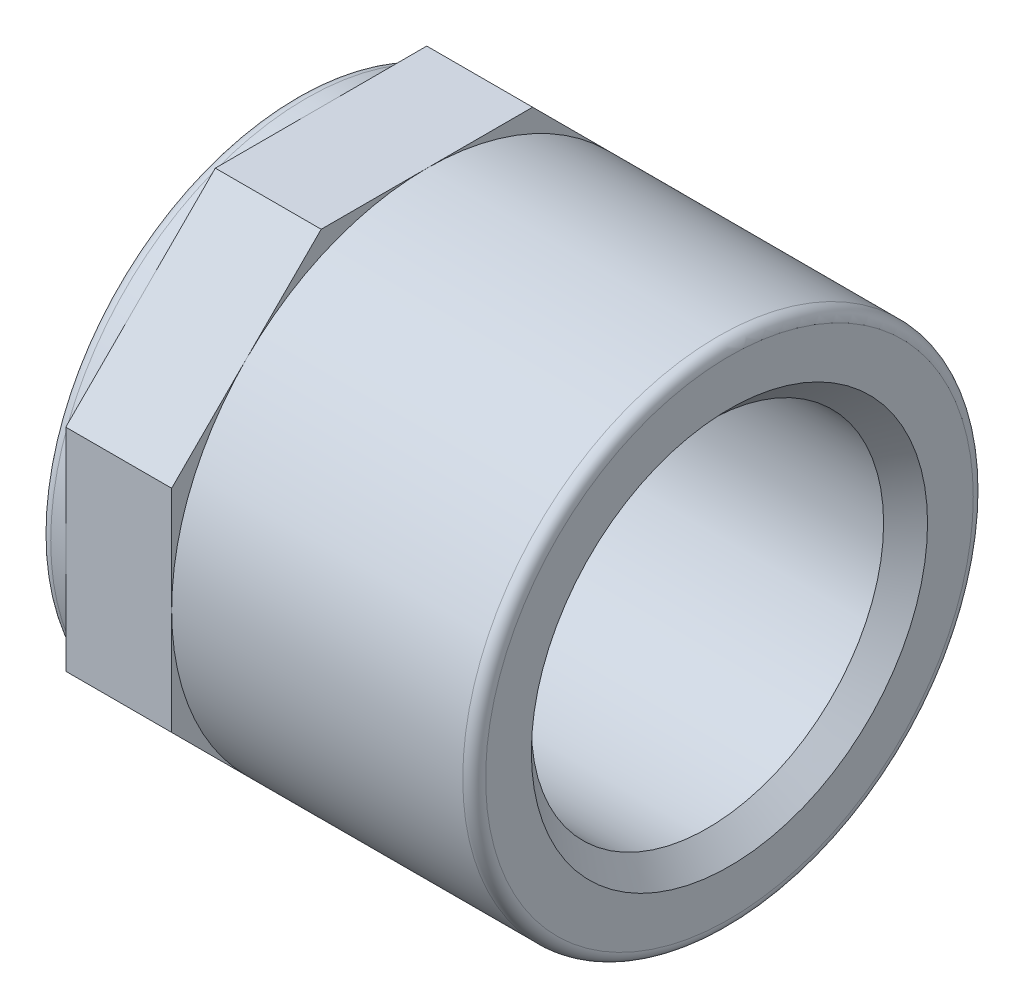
ISO-10303-21;
HEADER;
FILE_DESCRIPTION(('STEP AP214'),'2;1');
FILE_NAME('part.step','',(''),(''),'','','');
FILE_SCHEMA(('AUTOMOTIVE_DESIGN { 1 0 10303 214 1 1 1 1 }'));
ENDSEC;
DATA;
#1=APPLICATION_CONTEXT('core data for automotive mechanical design processes');
#2=APPLICATION_PROTOCOL_DEFINITION('international standard','automotive_design',2000,#1);
#3=PRODUCT_CONTEXT('',#1,'mechanical');
#4=PRODUCT('Part','Part','',(#3));
#5=PRODUCT_RELATED_PRODUCT_CATEGORY('part','',(#4));
#6=PRODUCT_DEFINITION_FORMATION('','',#4);
#7=PRODUCT_DEFINITION_CONTEXT('part definition',#1,'design');
#8=PRODUCT_DEFINITION('design','',#6,#7);
#9=PRODUCT_DEFINITION_SHAPE('','',#8);
#10=(LENGTH_UNIT() NAMED_UNIT(*) SI_UNIT(.MILLI.,.METRE.));
#11=(NAMED_UNIT(*) PLANE_ANGLE_UNIT() SI_UNIT($,.RADIAN.));
#12=(NAMED_UNIT(*) SI_UNIT($,.STERADIAN.) SOLID_ANGLE_UNIT());
#13=UNCERTAINTY_MEASURE_WITH_UNIT(LENGTH_MEASURE(1.E-05),#10,'distance_accuracy_value','');
#14=(GEOMETRIC_REPRESENTATION_CONTEXT(3) GLOBAL_UNCERTAINTY_ASSIGNED_CONTEXT((#13)) GLOBAL_UNIT_ASSIGNED_CONTEXT((#10,
#11,#12)) REPRESENTATION_CONTEXT('',''));
#15=CARTESIAN_POINT('',(0.,0.,0.));
#16=DIRECTION('',(0.,0.,1.));
#17=DIRECTION('',(1.,0.,0.));
#18=AXIS2_PLACEMENT_3D('',#15,#16,#17);
#19=CARTESIAN_POINT('',(0.,0.,0.));
#20=DIRECTION('',(-1.,0.,0.));
#21=DIRECTION('',(0.,0.,1.));
#22=AXIS2_PLACEMENT_3D('',#19,#20,#21);
#23=PLANE('',#22);
#24=CARTESIAN_POINT('',(0.,0.,0.));
#25=DIRECTION('',(1.,0.,0.));
#26=DIRECTION('',(0.,0.,-1.));
#27=AXIS2_PLACEMENT_3D('',#24,#25,#26);
#28=CIRCLE('',#27,13.5);
#29=CARTESIAN_POINT('',(0.,0.,-13.5));
#30=VERTEX_POINT('',#29);
#31=CARTESIAN_POINT('',(0.,9.54594154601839,-9.54594154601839));
#32=VERTEX_POINT('',#31);
#33=EDGE_CURVE('E168',#30,#32,#28,.T.);
#34=ORIENTED_EDGE('',*,*,#33,.F.);
#35=DIRECTION('',(0.,-1.,0.));
#36=VECTOR('',#35,1.);
#37=CARTESIAN_POINT('',(0.,5.59188309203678,-13.5));
#38=LINE('',#37,#36);
#39=CARTESIAN_POINT('',(0.,5.59188309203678,-13.5));
#40=VERTEX_POINT('',#39);
#41=EDGE_CURVE('E151',#40,#30,#38,.T.);
#42=ORIENTED_EDGE('',*,*,#41,.F.);
#43=DIRECTION('',(0.,-0.707106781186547,-0.707106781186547));
#44=VECTOR('',#43,1.);
#45=CARTESIAN_POINT('',(0.,13.5,-5.59188309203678));
#46=LINE('',#45,#44);
#47=EDGE_CURVE('E169',#32,#40,#46,.T.);
#48=ORIENTED_EDGE('',*,*,#47,.F.);
#49=EDGE_LOOP('',(#34,#42,#48));
#50=FACE_BOUND('',#49,.T.);
#51=ADVANCED_FACE('F34',(#50),#23,.F.);
#52=CARTESIAN_POINT('',(0.,13.5,0.));
#53=VERTEX_POINT('',#52);
#54=EDGE_CURVE('E49',#32,#53,#28,.T.);
#55=ORIENTED_EDGE('',*,*,#54,.F.);
#56=CARTESIAN_POINT('',(0.,13.5,-5.59188309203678));
#57=VERTEX_POINT('',#56);
#58=EDGE_CURVE('E166',#57,#32,#46,.T.);
#59=ORIENTED_EDGE('',*,*,#58,.F.);
#60=DIRECTION('',(0.,0.,-1.));
#61=VECTOR('',#60,1.);
#62=CARTESIAN_POINT('',(0.,13.5,5.59188309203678));
#63=LINE('',#62,#61);
#64=EDGE_CURVE('E192',#53,#57,#63,.T.);
#65=ORIENTED_EDGE('',*,*,#64,.F.);
#66=EDGE_LOOP('',(#55,#59,#65));
#67=FACE_BOUND('',#66,.T.);
#68=ADVANCED_FACE('F288',(#67),#23,.F.);
#69=CARTESIAN_POINT('',(0.,9.5459415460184,9.54594154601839));
#70=VERTEX_POINT('',#69);
#71=EDGE_CURVE('E334',#53,#70,#28,.T.);
#72=ORIENTED_EDGE('',*,*,#71,.F.);
#73=CARTESIAN_POINT('',(0.,13.5,5.59188309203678));
#74=VERTEX_POINT('',#73);
#75=EDGE_CURVE('E189',#74,#53,#63,.T.);
#76=ORIENTED_EDGE('',*,*,#75,.F.);
#77=DIRECTION('',(0.,0.707106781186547,-0.707106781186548));
#78=VECTOR('',#77,1.);
#79=CARTESIAN_POINT('',(0.,5.59188309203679,13.5));
#80=LINE('',#79,#78);
#81=EDGE_CURVE('E207',#70,#74,#80,.T.);
#82=ORIENTED_EDGE('',*,*,#81,.F.);
#83=EDGE_LOOP('',(#72,#76,#82));
#84=FACE_BOUND('',#83,.T.);
#85=ADVANCED_FACE('F293',(#84),#23,.F.);
#86=CARTESIAN_POINT('',(0.,0.,13.5));
#87=VERTEX_POINT('',#86);
#88=EDGE_CURVE('E333',#70,#87,#28,.T.);
#89=ORIENTED_EDGE('',*,*,#88,.F.);
#90=CARTESIAN_POINT('',(0.,5.59188309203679,13.5));
#91=VERTEX_POINT('',#90);
#92=EDGE_CURVE('E208',#91,#70,#80,.T.);
#93=ORIENTED_EDGE('',*,*,#92,.F.);
#94=DIRECTION('',(0.,1.,0.));
#95=VECTOR('',#94,1.);
#96=CARTESIAN_POINT('',(0.,-5.59188309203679,13.5));
#97=LINE('',#96,#95);
#98=EDGE_CURVE('E203',#87,#91,#97,.T.);
#99=ORIENTED_EDGE('',*,*,#98,.F.);
#100=EDGE_LOOP('',(#89,#93,#99));
#101=FACE_BOUND('',#100,.T.);
#102=ADVANCED_FACE('F353',(#101),#23,.F.);
#103=CARTESIAN_POINT('',(0.,-9.5459415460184,9.5459415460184));
#104=VERTEX_POINT('',#103);
#105=EDGE_CURVE('E332',#87,#104,#28,.T.);
#106=ORIENTED_EDGE('',*,*,#105,.F.);
#107=CARTESIAN_POINT('',(0.,-5.59188309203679,13.5));
#108=VERTEX_POINT('',#107);
#109=EDGE_CURVE('E204',#108,#87,#97,.T.);
#110=ORIENTED_EDGE('',*,*,#109,.F.);
#111=DIRECTION('',(0.,0.707106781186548,0.707106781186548));
#112=VECTOR('',#111,1.);
#113=CARTESIAN_POINT('',(0.,-13.5,5.59188309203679));
#114=LINE('',#113,#112);
#115=EDGE_CURVE('E199',#104,#108,#114,.T.);
#116=ORIENTED_EDGE('',*,*,#115,.F.);
#117=EDGE_LOOP('',(#106,#110,#116));
#118=FACE_BOUND('',#117,.T.);
#119=ADVANCED_FACE('F319',(#118),#23,.F.);
#120=CARTESIAN_POINT('',(0.,-13.5,0.));
#121=VERTEX_POINT('',#120);
#122=EDGE_CURVE('E180',#104,#121,#28,.T.);
#123=ORIENTED_EDGE('',*,*,#122,.F.);
#124=CARTESIAN_POINT('',(0.,-13.5,5.59188309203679));
#125=VERTEX_POINT('',#124);
#126=EDGE_CURVE('E200',#125,#104,#114,.T.);
#127=ORIENTED_EDGE('',*,*,#126,.F.);
#128=DIRECTION('',(0.,0.,1.));
#129=VECTOR('',#128,1.);
#130=CARTESIAN_POINT('',(0.,-13.5,-5.59188309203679));
#131=LINE('',#130,#129);
#132=EDGE_CURVE('E195',#121,#125,#131,.T.);
#133=ORIENTED_EDGE('',*,*,#132,.F.);
#134=EDGE_LOOP('',(#123,#127,#133));
#135=FACE_BOUND('',#134,.T.);
#136=ADVANCED_FACE('F311',(#135),#23,.F.);
#137=CARTESIAN_POINT('',(0.,-9.54594154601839,-9.5459415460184));
#138=VERTEX_POINT('',#137);
#139=EDGE_CURVE('E178',#121,#138,#28,.T.);
#140=ORIENTED_EDGE('',*,*,#139,.F.);
#141=CARTESIAN_POINT('',(0.,-13.5,-5.59188309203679));
#142=VERTEX_POINT('',#141);
#143=EDGE_CURVE('E196',#142,#121,#131,.T.);
#144=ORIENTED_EDGE('',*,*,#143,.F.);
#145=DIRECTION('',(0.,-0.707106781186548,0.707106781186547));
#146=VECTOR('',#145,1.);
#147=CARTESIAN_POINT('',(0.,-5.59188309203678,-13.5));
#148=LINE('',#147,#146);
#149=EDGE_CURVE('E161',#138,#142,#148,.T.);
#150=ORIENTED_EDGE('',*,*,#149,.F.);
#151=EDGE_LOOP('',(#140,#144,#150));
#152=FACE_BOUND('',#151,.T.);
#153=ADVANCED_FACE('F299',(#152),#23,.F.);
#154=CARTESIAN_POINT('',(-5.6,0.,0.));
#155=DIRECTION('',(-1.,0.,0.));
#156=DIRECTION('',(0.,0.,1.));
#157=AXIS2_PLACEMENT_3D('',#154,#155,#156);
#158=PLANE('',#157);
#159=CARTESIAN_POINT('',(-5.6,0.,0.));
#160=DIRECTION('',(-1.,0.,0.));
#161=DIRECTION('',(0.,0.,1.));
#162=AXIS2_PLACEMENT_3D('',#159,#160,#161);
#163=CIRCLE('',#162,13.5);
#164=CARTESIAN_POINT('',(-5.6,0.,13.5));
#165=VERTEX_POINT('',#164);
#166=CARTESIAN_POINT('',(-5.6,9.5459415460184,9.54594154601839));
#167=VERTEX_POINT('',#166);
#168=EDGE_CURVE('E172',#165,#167,#163,.T.);
#169=ORIENTED_EDGE('',*,*,#168,.F.);
#170=DIRECTION('',(0.,1.,0.));
#171=VECTOR('',#170,1.);
#172=CARTESIAN_POINT('',(-5.6,-5.59188309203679,13.5));
#173=LINE('',#172,#171);
#174=CARTESIAN_POINT('',(-5.6,5.59188309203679,13.5));
#175=VERTEX_POINT('',#174);
#176=EDGE_CURVE('E235',#165,#175,#173,.T.);
#177=ORIENTED_EDGE('',*,*,#176,.T.);
#178=DIRECTION('',(0.,0.707106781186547,-0.707106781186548));
#179=VECTOR('',#178,1.);
#180=CARTESIAN_POINT('',(-5.6,5.59188309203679,13.5));
#181=LINE('',#180,#179);
#182=EDGE_CURVE('E239',#175,#167,#181,.T.);
#183=ORIENTED_EDGE('',*,*,#182,.T.);
#184=EDGE_LOOP('',(#169,#177,#183));
#185=FACE_BOUND('',#184,.T.);
#186=ADVANCED_FACE('F306',(#185),#158,.T.);
#187=CARTESIAN_POINT('',(-5.6,13.5,0.));
#188=VERTEX_POINT('',#187);
#189=EDGE_CURVE('E179',#167,#188,#163,.T.);
#190=ORIENTED_EDGE('',*,*,#189,.F.);
#191=CARTESIAN_POINT('',(-5.6,13.5,5.59188309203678));
#192=VERTEX_POINT('',#191);
#193=EDGE_CURVE('E238',#167,#192,#181,.T.);
#194=ORIENTED_EDGE('',*,*,#193,.T.);
#195=DIRECTION('',(0.,0.,-1.));
#196=VECTOR('',#195,1.);
#197=CARTESIAN_POINT('',(-5.6,13.5,5.59188309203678));
#198=LINE('',#197,#196);
#199=EDGE_CURVE('E212',#192,#188,#198,.T.);
#200=ORIENTED_EDGE('',*,*,#199,.T.);
#201=EDGE_LOOP('',(#190,#194,#200));
#202=FACE_BOUND('',#201,.T.);
#203=ADVANCED_FACE('F317',(#202),#158,.T.);
#204=CARTESIAN_POINT('',(-5.6,9.54594154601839,-9.54594154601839));
#205=VERTEX_POINT('',#204);
#206=EDGE_CURVE('E182',#188,#205,#163,.T.);
#207=ORIENTED_EDGE('',*,*,#206,.F.);
#208=CARTESIAN_POINT('',(-5.6,13.5,-5.59188309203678));
#209=VERTEX_POINT('',#208);
#210=EDGE_CURVE('E187',#188,#209,#198,.T.);
#211=ORIENTED_EDGE('',*,*,#210,.T.);
#212=DIRECTION('',(0.,-0.707106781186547,-0.707106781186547));
#213=VECTOR('',#212,1.);
#214=CARTESIAN_POINT('',(-5.6,13.5,-5.59188309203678));
#215=LINE('',#214,#213);
#216=EDGE_CURVE('E216',#209,#205,#215,.T.);
#217=ORIENTED_EDGE('',*,*,#216,.T.);
#218=EDGE_LOOP('',(#207,#211,#217));
#219=FACE_BOUND('',#218,.T.);
#220=ADVANCED_FACE('F598',(#219),#158,.T.);
#221=CARTESIAN_POINT('',(-5.6,0.,-13.5));
#222=VERTEX_POINT('',#221);
#223=EDGE_CURVE('E378',#205,#222,#163,.T.);
#224=ORIENTED_EDGE('',*,*,#223,.F.);
#225=CARTESIAN_POINT('',(-5.6,5.59188309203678,-13.5));
#226=VERTEX_POINT('',#225);
#227=EDGE_CURVE('E215',#205,#226,#215,.T.);
#228=ORIENTED_EDGE('',*,*,#227,.T.);
#229=DIRECTION('',(0.,-1.,0.));
#230=VECTOR('',#229,1.);
#231=CARTESIAN_POINT('',(-5.6,5.59188309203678,-13.5));
#232=LINE('',#231,#230);
#233=EDGE_CURVE('E220',#226,#222,#232,.T.);
#234=ORIENTED_EDGE('',*,*,#233,.T.);
#235=EDGE_LOOP('',(#224,#228,#234));
#236=FACE_BOUND('',#235,.T.);
#237=ADVANCED_FACE('F589',(#236),#158,.T.);
#238=CARTESIAN_POINT('',(-5.6,-9.54594154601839,-9.5459415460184));
#239=VERTEX_POINT('',#238);
#240=EDGE_CURVE('E377',#222,#239,#163,.T.);
#241=ORIENTED_EDGE('',*,*,#240,.F.);
#242=CARTESIAN_POINT('',(-5.6,-5.59188309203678,-13.5));
#243=VERTEX_POINT('',#242);
#244=EDGE_CURVE('E219',#222,#243,#232,.T.);
#245=ORIENTED_EDGE('',*,*,#244,.T.);
#246=DIRECTION('',(0.,-0.707106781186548,0.707106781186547));
#247=VECTOR('',#246,1.);
#248=CARTESIAN_POINT('',(-5.6,-5.59188309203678,-13.5));
#249=LINE('',#248,#247);
#250=EDGE_CURVE('E224',#243,#239,#249,.T.);
#251=ORIENTED_EDGE('',*,*,#250,.T.);
#252=EDGE_LOOP('',(#241,#245,#251));
#253=FACE_BOUND('',#252,.T.);
#254=ADVANCED_FACE('F387',(#253),#158,.T.);
#255=CARTESIAN_POINT('',(-5.6,-13.5,0.));
#256=VERTEX_POINT('',#255);
#257=EDGE_CURVE('E369',#239,#256,#163,.T.);
#258=ORIENTED_EDGE('',*,*,#257,.F.);
#259=CARTESIAN_POINT('',(-5.6,-13.5,-5.59188309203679));
#260=VERTEX_POINT('',#259);
#261=EDGE_CURVE('E223',#239,#260,#249,.T.);
#262=ORIENTED_EDGE('',*,*,#261,.T.);
#263=DIRECTION('',(0.,0.,1.));
#264=VECTOR('',#263,1.);
#265=CARTESIAN_POINT('',(-5.6,-13.5,-5.59188309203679));
#266=LINE('',#265,#264);
#267=EDGE_CURVE('E228',#260,#256,#266,.T.);
#268=ORIENTED_EDGE('',*,*,#267,.T.);
#269=EDGE_LOOP('',(#258,#262,#268));
#270=FACE_BOUND('',#269,.T.);
#271=ADVANCED_FACE('F368',(#270),#158,.T.);
#272=CARTESIAN_POINT('',(-5.6,-9.5459415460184,9.5459415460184));
#273=VERTEX_POINT('',#272);
#274=EDGE_CURVE('E375',#256,#273,#163,.T.);
#275=ORIENTED_EDGE('',*,*,#274,.F.);
#276=CARTESIAN_POINT('',(-5.6,-13.5,5.59188309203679));
#277=VERTEX_POINT('',#276);
#278=EDGE_CURVE('E227',#256,#277,#266,.T.);
#279=ORIENTED_EDGE('',*,*,#278,.T.);
#280=DIRECTION('',(0.,0.707106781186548,0.707106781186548));
#281=VECTOR('',#280,1.);
#282=CARTESIAN_POINT('',(-5.6,-13.5,5.59188309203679));
#283=LINE('',#282,#281);
#284=EDGE_CURVE('E232',#277,#273,#283,.T.);
#285=ORIENTED_EDGE('',*,*,#284,.T.);
#286=EDGE_LOOP('',(#275,#279,#285));
#287=FACE_BOUND('',#286,.T.);
#288=ADVANCED_FACE('F307',(#287),#158,.T.);
#289=CARTESIAN_POINT('',(0.,13.5,5.59188309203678));
#290=DIRECTION('',(0.,1.,0.));
#291=DIRECTION('',(0.,0.,1.));
#292=AXIS2_PLACEMENT_3D('',#289,#290,#291);
#293=PLANE('',#292);
#294=ORIENTED_EDGE('',*,*,#199,.F.);
#295=DIRECTION('',(-1.,0.,0.));
#296=VECTOR('',#295,1.);
#297=CARTESIAN_POINT('',(0.,13.5,5.59188309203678));
#298=LINE('',#297,#296);
#299=EDGE_CURVE('E242',#74,#192,#298,.T.);
#300=ORIENTED_EDGE('',*,*,#299,.F.);
#301=ORIENTED_EDGE('',*,*,#75,.T.);
#302=ORIENTED_EDGE('',*,*,#64,.T.);
#303=DIRECTION('',(-1.,0.,0.));
#304=VECTOR('',#303,1.);
#305=CARTESIAN_POINT('',(0.,13.5,-5.59188309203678));
#306=LINE('',#305,#304);
#307=EDGE_CURVE('E211',#57,#209,#306,.T.);
#308=ORIENTED_EDGE('',*,*,#307,.T.);
#309=ORIENTED_EDGE('',*,*,#210,.F.);
#310=EDGE_LOOP('',(#294,#300,#301,#302,#308,#309));
#311=FACE_BOUND('',#310,.T.);
#312=ADVANCED_FACE('F343',(#311),#293,.T.);
#313=CARTESIAN_POINT('',(0.,5.59188309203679,13.5));
#314=DIRECTION('',(0.,0.707106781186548,0.707106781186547));
#315=DIRECTION('',(0.,-0.707106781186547,0.707106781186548));
#316=AXIS2_PLACEMENT_3D('',#313,#314,#315);
#317=PLANE('',#316);
#318=ORIENTED_EDGE('',*,*,#182,.F.);
#319=DIRECTION('',(-1.,0.,0.));
#320=VECTOR('',#319,1.);
#321=CARTESIAN_POINT('',(0.,5.59188309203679,13.5));
#322=LINE('',#321,#320);
#323=EDGE_CURVE('E245',#91,#175,#322,.T.);
#324=ORIENTED_EDGE('',*,*,#323,.F.);
#325=ORIENTED_EDGE('',*,*,#92,.T.);
#326=ORIENTED_EDGE('',*,*,#81,.T.);
#327=ORIENTED_EDGE('',*,*,#299,.T.);
#328=ORIENTED_EDGE('',*,*,#193,.F.);
#329=EDGE_LOOP('',(#318,#324,#325,#326,#327,#328));
#330=FACE_BOUND('',#329,.T.);
#331=ADVANCED_FACE('F348',(#330),#317,.T.);
#332=CARTESIAN_POINT('',(0.,-5.59188309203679,13.5));
#333=DIRECTION('',(0.,0.,1.));
#334=DIRECTION('',(1.,0.,0.));
#335=AXIS2_PLACEMENT_3D('',#332,#333,#334);
#336=PLANE('',#335);
#337=CARTESIAN_POINT('',(-5.6,-5.59188309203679,13.5));
#338=VERTEX_POINT('',#337);
#339=EDGE_CURVE('E236',#338,#165,#173,.T.);
#340=ORIENTED_EDGE('',*,*,#339,.F.);
#341=DIRECTION('',(-1.,0.,0.));
#342=VECTOR('',#341,1.);
#343=CARTESIAN_POINT('',(0.,-5.59188309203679,13.5));
#344=LINE('',#343,#342);
#345=EDGE_CURVE('E248',#108,#338,#344,.T.);
#346=ORIENTED_EDGE('',*,*,#345,.F.);
#347=ORIENTED_EDGE('',*,*,#109,.T.);
#348=ORIENTED_EDGE('',*,*,#98,.T.);
#349=ORIENTED_EDGE('',*,*,#323,.T.);
#350=ORIENTED_EDGE('',*,*,#176,.F.);
#351=EDGE_LOOP('',(#340,#346,#347,#348,#349,#350));
#352=FACE_BOUND('',#351,.T.);
#353=ADVANCED_FACE('F358',(#352),#336,.T.);
#354=CARTESIAN_POINT('',(0.,-13.5,5.59188309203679));
#355=DIRECTION('',(0.,-0.707106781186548,0.707106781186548));
#356=DIRECTION('',(0.,-0.707106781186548,-0.707106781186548));
#357=AXIS2_PLACEMENT_3D('',#354,#355,#356);
#358=PLANE('',#357);
#359=ORIENTED_EDGE('',*,*,#284,.F.);
#360=DIRECTION('',(-1.,0.,0.));
#361=VECTOR('',#360,1.);
#362=CARTESIAN_POINT('',(0.,-13.5,5.59188309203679));
#363=LINE('',#362,#361);
#364=EDGE_CURVE('E251',#125,#277,#363,.T.);
#365=ORIENTED_EDGE('',*,*,#364,.F.);
#366=ORIENTED_EDGE('',*,*,#126,.T.);
#367=ORIENTED_EDGE('',*,*,#115,.T.);
#368=ORIENTED_EDGE('',*,*,#345,.T.);
#369=EDGE_CURVE('E231',#273,#338,#283,.T.);
#370=ORIENTED_EDGE('',*,*,#369,.F.);
#371=EDGE_LOOP('',(#359,#365,#366,#367,#368,#370));
#372=FACE_BOUND('',#371,.T.);
#373=ADVANCED_FACE('F362',(#372),#358,.T.);
#374=CARTESIAN_POINT('',(0.,-13.5,-5.59188309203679));
#375=DIRECTION('',(0.,-1.,0.));
#376=DIRECTION('',(0.,0.,-1.));
#377=AXIS2_PLACEMENT_3D('',#374,#375,#376);
#378=PLANE('',#377);
#379=ORIENTED_EDGE('',*,*,#267,.F.);
#380=DIRECTION('',(-1.,0.,0.));
#381=VECTOR('',#380,1.);
#382=CARTESIAN_POINT('',(0.,-13.5,-5.59188309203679));
#383=LINE('',#382,#381);
#384=EDGE_CURVE('E254',#142,#260,#383,.T.);
#385=ORIENTED_EDGE('',*,*,#384,.F.);
#386=ORIENTED_EDGE('',*,*,#143,.T.);
#387=ORIENTED_EDGE('',*,*,#132,.T.);
#388=ORIENTED_EDGE('',*,*,#364,.T.);
#389=ORIENTED_EDGE('',*,*,#278,.F.);
#390=EDGE_LOOP('',(#379,#385,#386,#387,#388,#389));
#391=FACE_BOUND('',#390,.T.);
#392=ADVANCED_FACE('F329',(#391),#378,.T.);
#393=CARTESIAN_POINT('',(0.,-5.59188309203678,-13.5));
#394=DIRECTION('',(0.,-0.707106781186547,-0.707106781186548));
#395=DIRECTION('',(0.,0.707106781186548,-0.707106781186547));
#396=AXIS2_PLACEMENT_3D('',#393,#394,#395);
#397=PLANE('',#396);
#398=ORIENTED_EDGE('',*,*,#250,.F.);
#399=DIRECTION('',(-1.,0.,0.));
#400=VECTOR('',#399,1.);
#401=CARTESIAN_POINT('',(0.,-5.59188309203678,-13.5));
#402=LINE('',#401,#400);
#403=CARTESIAN_POINT('',(0.,-5.59188309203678,-13.5));
#404=VERTEX_POINT('',#403);
#405=EDGE_CURVE('E257',#404,#243,#402,.T.);
#406=ORIENTED_EDGE('',*,*,#405,.F.);
#407=EDGE_CURVE('E165',#404,#138,#148,.T.);
#408=ORIENTED_EDGE('',*,*,#407,.T.);
#409=ORIENTED_EDGE('',*,*,#149,.T.);
#410=ORIENTED_EDGE('',*,*,#384,.T.);
#411=ORIENTED_EDGE('',*,*,#261,.F.);
#412=EDGE_LOOP('',(#398,#406,#408,#409,#410,#411));
#413=FACE_BOUND('',#412,.T.);
#414=ADVANCED_FACE('F397',(#413),#397,.T.);
#415=CARTESIAN_POINT('',(0.,5.59188309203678,-13.5));
#416=DIRECTION('',(0.,0.,-1.));
#417=DIRECTION('',(-1.,0.,0.));
#418=AXIS2_PLACEMENT_3D('',#415,#416,#417);
#419=PLANE('',#418);
#420=ORIENTED_EDGE('',*,*,#233,.F.);
#421=DIRECTION('',(-1.,0.,0.));
#422=VECTOR('',#421,1.);
#423=CARTESIAN_POINT('',(0.,5.59188309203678,-13.5));
#424=LINE('',#423,#422);
#425=EDGE_CURVE('E158',#40,#226,#424,.T.);
#426=ORIENTED_EDGE('',*,*,#425,.F.);
#427=ORIENTED_EDGE('',*,*,#41,.T.);
#428=EDGE_CURVE('E155',#30,#404,#38,.T.);
#429=ORIENTED_EDGE('',*,*,#428,.T.);
#430=ORIENTED_EDGE('',*,*,#405,.T.);
#431=ORIENTED_EDGE('',*,*,#244,.F.);
#432=EDGE_LOOP('',(#420,#426,#427,#429,#430,#431));
#433=FACE_BOUND('',#432,.T.);
#434=ADVANCED_FACE('F153',(#433),#419,.T.);
#435=CARTESIAN_POINT('',(0.,13.5,-5.59188309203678));
#436=DIRECTION('',(0.,0.707106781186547,-0.707106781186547));
#437=DIRECTION('',(0.,0.707106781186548,0.707106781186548));
#438=AXIS2_PLACEMENT_3D('',#435,#436,#437);
#439=PLANE('',#438);
#440=ORIENTED_EDGE('',*,*,#216,.F.);
#441=ORIENTED_EDGE('',*,*,#307,.F.);
#442=ORIENTED_EDGE('',*,*,#58,.T.);
#443=ORIENTED_EDGE('',*,*,#47,.T.);
#444=ORIENTED_EDGE('',*,*,#425,.T.);
#445=ORIENTED_EDGE('',*,*,#227,.F.);
#446=EDGE_LOOP('',(#440,#441,#442,#443,#444,#445));
#447=FACE_BOUND('',#446,.T.);
#448=ADVANCED_FACE('F298',(#447),#439,.T.);
#449=EDGE_CURVE('E57',#138,#30,#28,.T.);
#450=ORIENTED_EDGE('',*,*,#449,.F.);
#451=ORIENTED_EDGE('',*,*,#407,.F.);
#452=ORIENTED_EDGE('',*,*,#428,.F.);
#453=EDGE_LOOP('',(#450,#451,#452));
#454=FACE_BOUND('',#453,.T.);
#455=ADVANCED_FACE('F163',(#454),#23,.F.);
#456=EDGE_CURVE('E188',#273,#165,#163,.T.);
#457=ORIENTED_EDGE('',*,*,#456,.F.);
#458=ORIENTED_EDGE('',*,*,#369,.T.);
#459=ORIENTED_EDGE('',*,*,#339,.T.);
#460=EDGE_LOOP('',(#457,#458,#459));
#461=FACE_BOUND('',#460,.T.);
#462=ADVANCED_FACE('F297',(#461),#158,.T.);
#463=CARTESIAN_POINT('',(-5.6,0.,0.));
#464=DIRECTION('',(-1.,0.,0.));
#465=DIRECTION('',(0.,0.,1.));
#466=AXIS2_PLACEMENT_3D('',#463,#464,#465);
#467=CYLINDRICAL_SURFACE('',#466,13.5);
#468=CARTESIAN_POINT('',(-6.3955,0.,0.));
#469=DIRECTION('',(-1.,0.,0.));
#470=DIRECTION('',(0.,0.,1.));
#471=AXIS2_PLACEMENT_3D('',#468,#469,#470);
#472=CIRCLE('',#471,13.5);
#473=CARTESIAN_POINT('',(-6.3955,0.,13.5));
#474=VERTEX_POINT('',#473);
#475=EDGE_CURVE('E11',#474,#474,#472,.F.);
#476=ORIENTED_EDGE('',*,*,#475,.T.);
#477=EDGE_LOOP('',(#476));
#478=FACE_BOUND('',#477,.T.);
#479=ORIENTED_EDGE('',*,*,#168,.T.);
#480=ORIENTED_EDGE('',*,*,#189,.T.);
#481=ORIENTED_EDGE('',*,*,#206,.T.);
#482=ORIENTED_EDGE('',*,*,#223,.T.);
#483=ORIENTED_EDGE('',*,*,#240,.T.);
#484=ORIENTED_EDGE('',*,*,#257,.T.);
#485=ORIENTED_EDGE('',*,*,#274,.T.);
#486=ORIENTED_EDGE('',*,*,#456,.T.);
#487=EDGE_LOOP('',(#479,#480,#481,#482,#483,#484,#485,#486));
#488=FACE_BOUND('',#487,.T.);
#489=ADVANCED_FACE('F304',(#478,#488),#467,.T.);
#490=CARTESIAN_POINT('',(-7.,0.,0.));
#491=DIRECTION('',(-1.,0.,0.));
#492=DIRECTION('',(0.,0.,1.));
#493=AXIS2_PLACEMENT_3D('',#490,#491,#492);
#494=PLANE('',#493);
#495=CARTESIAN_POINT('',(-7.,0.,0.));
#496=DIRECTION('',(-1.,0.,0.));
#497=DIRECTION('',(0.,0.,1.));
#498=AXIS2_PLACEMENT_3D('',#495,#496,#497);
#499=CIRCLE('',#498,12.8955);
#500=CARTESIAN_POINT('',(-7.,0.,12.8955));
#501=VERTEX_POINT('',#500);
#502=EDGE_CURVE('E42',#501,#501,#499,.T.);
#503=ORIENTED_EDGE('',*,*,#502,.T.);
#504=EDGE_LOOP('',(#503));
#505=FACE_BOUND('',#504,.T.);
#506=ADVANCED_FACE('F276',(#505),#494,.T.);
#507=CARTESIAN_POINT('',(0.,0.,0.));
#508=DIRECTION('',(1.,0.,0.));
#509=DIRECTION('',(0.,0.,-1.));
#510=AXIS2_PLACEMENT_3D('',#507,#508,#509);
#511=CYLINDRICAL_SURFACE('',#510,13.5);
#512=CARTESIAN_POINT('',(15.3955,0.,0.));
#513=DIRECTION('',(1.,0.,0.));
#514=DIRECTION('',(0.,0.,-1.));
#515=AXIS2_PLACEMENT_3D('',#512,#513,#514);
#516=CIRCLE('',#515,13.5);
#517=CARTESIAN_POINT('',(15.3955,0.,-13.5));
#518=VERTEX_POINT('',#517);
#519=EDGE_CURVE('E271',#518,#518,#516,.F.);
#520=ORIENTED_EDGE('',*,*,#519,.T.);
#521=EDGE_LOOP('',(#520));
#522=FACE_BOUND('',#521,.T.);
#523=ORIENTED_EDGE('',*,*,#33,.T.);
#524=ORIENTED_EDGE('',*,*,#54,.T.);
#525=ORIENTED_EDGE('',*,*,#71,.T.);
#526=ORIENTED_EDGE('',*,*,#88,.T.);
#527=ORIENTED_EDGE('',*,*,#105,.T.);
#528=ORIENTED_EDGE('',*,*,#122,.T.);
#529=ORIENTED_EDGE('',*,*,#139,.T.);
#530=ORIENTED_EDGE('',*,*,#449,.T.);
#531=EDGE_LOOP('',(#523,#524,#525,#526,#527,#528,#529,#530));
#532=FACE_BOUND('',#531,.T.);
#533=ADVANCED_FACE('F176',(#522,#532),#511,.T.);
#534=CARTESIAN_POINT('',(16.,0.,0.));
#535=DIRECTION('',(1.,0.,0.));
#536=DIRECTION('',(0.,0.,-1.));
#537=AXIS2_PLACEMENT_3D('',#534,#535,#536);
#538=PLANE('',#537);
#539=CARTESIAN_POINT('',(16.,0.,0.));
#540=DIRECTION('',(1.,0.,0.));
#541=DIRECTION('',(0.,0.,-1.));
#542=AXIS2_PLACEMENT_3D('',#539,#540,#541);
#543=CIRCLE('',#542,12.8955);
#544=CARTESIAN_POINT('',(16.,0.,-12.8955));
#545=VERTEX_POINT('',#544);
#546=EDGE_CURVE('E268',#545,#545,#543,.T.);
#547=ORIENTED_EDGE('',*,*,#546,.T.);
#548=EDGE_LOOP('',(#547));
#549=FACE_BOUND('',#548,.T.);
#550=CARTESIAN_POINT('',(16.,0.,0.));
#551=DIRECTION('',(1.,0.,0.));
#552=DIRECTION('',(0.,0.,-1.));
#553=AXIS2_PLACEMENT_3D('',#550,#551,#552);
#554=CIRCLE('',#553,10.4775);
#555=CARTESIAN_POINT('',(16.,0.,-10.4775));
#556=VERTEX_POINT('',#555);
#557=EDGE_CURVE('E265',#556,#556,#554,.F.);
#558=ORIENTED_EDGE('',*,*,#557,.T.);
#559=EDGE_LOOP('',(#558));
#560=FACE_BOUND('',#559,.T.);
#561=ADVANCED_FACE('F420',(#549,#560),#538,.T.);
#562=CARTESIAN_POINT('',(0.,0.,0.));
#563=DIRECTION('',(-1.,0.,0.));
#564=DIRECTION('',(0.,0.,1.));
#565=AXIS2_PLACEMENT_3D('',#562,#563,#564);
#566=PLANE('',#565);
#567=CARTESIAN_POINT('',(0.,0.,0.));
#568=DIRECTION('',(1.,0.,0.));
#569=DIRECTION('',(0.,0.,-1.));
#570=AXIS2_PLACEMENT_3D('',#567,#568,#569);
#571=CIRCLE('',#570,9.31549999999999);
#572=CARTESIAN_POINT('',(0.,0.,-9.31549999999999));
#573=VERTEX_POINT('',#572);
#574=EDGE_CURVE('E173',#573,#573,#571,.T.);
#575=ORIENTED_EDGE('',*,*,#574,.T.);
#576=EDGE_LOOP('',(#575));
#577=FACE_BOUND('',#576,.T.);
#578=ADVANCED_FACE('F409',(#577),#566,.F.);
#579=CARTESIAN_POINT('',(16.,0.,0.));
#580=DIRECTION('',(1.,0.,0.));
#581=DIRECTION('',(0.,0.,-1.));
#582=AXIS2_PLACEMENT_3D('',#579,#580,#581);
#583=CYLINDRICAL_SURFACE('',#582,9.31549999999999);
#584=CARTESIAN_POINT('',(14.838,0.,0.));
#585=DIRECTION('',(1.,0.,0.));
#586=DIRECTION('',(0.,0.,-1.));
#587=AXIS2_PLACEMENT_3D('',#584,#585,#586);
#588=CIRCLE('',#587,9.31549999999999);
#589=CARTESIAN_POINT('',(14.838,0.,-9.31549999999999));
#590=VERTEX_POINT('',#589);
#591=EDGE_CURVE('E262',#590,#590,#588,.T.);
#592=ORIENTED_EDGE('',*,*,#591,.T.);
#593=EDGE_LOOP('',(#592));
#594=FACE_BOUND('',#593,.T.);
#595=ORIENTED_EDGE('',*,*,#574,.F.);
#596=EDGE_LOOP('',(#595));
#597=FACE_BOUND('',#596,.T.);
#598=ADVANCED_FACE('F404',(#594,#597),#583,.F.);
#599=CARTESIAN_POINT('',(14.838,0.,0.));
#600=DIRECTION('',(1.,0.,0.));
#601=DIRECTION('',(0.,0.,-1.));
#602=AXIS2_PLACEMENT_3D('',#599,#600,#601);
#603=CONICAL_SURFACE('',#602,9.31549999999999,0.785398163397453);
#604=ORIENTED_EDGE('',*,*,#557,.F.);
#605=EDGE_LOOP('',(#604));
#606=FACE_BOUND('',#605,.T.);
#607=ORIENTED_EDGE('',*,*,#591,.F.);
#608=EDGE_LOOP('',(#607));
#609=FACE_BOUND('',#608,.T.);
#610=ADVANCED_FACE('F284',(#606,#609),#603,.F.);
#611=CARTESIAN_POINT('',(15.3955,0.,0.));
#612=DIRECTION('',(1.,0.,0.));
#613=DIRECTION('',(0.,0.,-1.));
#614=AXIS2_PLACEMENT_3D('',#611,#612,#613);
#615=TOROIDAL_SURFACE('',#614,12.8955,0.6045);
#616=ORIENTED_EDGE('',*,*,#519,.F.);
#617=EDGE_LOOP('',(#616));
#618=FACE_BOUND('',#617,.T.);
#619=ORIENTED_EDGE('',*,*,#546,.F.);
#620=EDGE_LOOP('',(#619));
#621=FACE_BOUND('',#620,.T.);
#622=ADVANCED_FACE('F279',(#618,#621),#615,.T.);
#623=CARTESIAN_POINT('',(-6.3955,0.,0.));
#624=DIRECTION('',(-1.,0.,0.));
#625=DIRECTION('',(0.,0.,1.));
#626=AXIS2_PLACEMENT_3D('',#623,#624,#625);
#627=TOROIDAL_SURFACE('',#626,12.8955,0.6045);
#628=ORIENTED_EDGE('',*,*,#475,.F.);
#629=EDGE_LOOP('',(#628));
#630=FACE_BOUND('',#629,.T.);
#631=ORIENTED_EDGE('',*,*,#502,.F.);
#632=EDGE_LOOP('',(#631));
#633=FACE_BOUND('',#632,.T.);
#634=ADVANCED_FACE('F36',(#630,#633),#627,.T.);
#635=CLOSED_SHELL('',(#51,#68,#85,#102,#119,#136,#153,#186,#203,#220,#237,#254,#271,#288,#312,
#331,#353,#373,#392,#414,#434,#448,#455,#462,#489,#506,#533,#561,#578,#598,#610,#622,#634));
#636=MANIFOLD_SOLID_BREP('B2',#635);
#637=ADVANCED_BREP_SHAPE_REPRESENTATION('',(#18,#636),#14);
#638=SHAPE_DEFINITION_REPRESENTATION(#9,#637);
ENDSEC;
END-ISO-10303-21;
